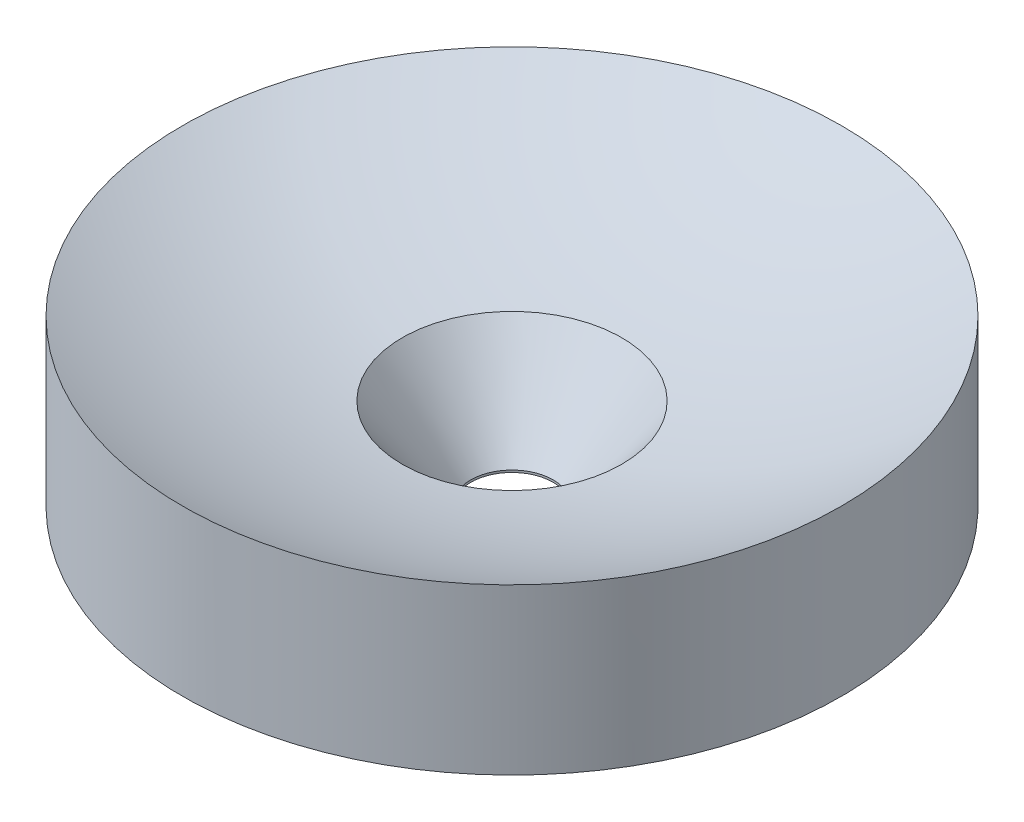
ISO-10303-21;
HEADER;
FILE_DESCRIPTION(('STEP AP214'),'2;1');
FILE_NAME('part.step','',(''),(''),'','','');
FILE_SCHEMA(('AUTOMOTIVE_DESIGN { 1 0 10303 214 1 1 1 1 }'));
ENDSEC;
DATA;
#1=APPLICATION_CONTEXT('core data for automotive mechanical design processes');
#2=APPLICATION_PROTOCOL_DEFINITION('international standard','automotive_design',2000,#1);
#3=PRODUCT_CONTEXT('',#1,'mechanical');
#4=PRODUCT('Part','Part','',(#3));
#5=PRODUCT_RELATED_PRODUCT_CATEGORY('part','',(#4));
#6=PRODUCT_DEFINITION_FORMATION('','',#4);
#7=PRODUCT_DEFINITION_CONTEXT('part definition',#1,'design');
#8=PRODUCT_DEFINITION('design','',#6,#7);
#9=PRODUCT_DEFINITION_SHAPE('','',#8);
#10=(LENGTH_UNIT() NAMED_UNIT(*) SI_UNIT(.MILLI.,.METRE.));
#11=(NAMED_UNIT(*) PLANE_ANGLE_UNIT() SI_UNIT($,.RADIAN.));
#12=(NAMED_UNIT(*) SI_UNIT($,.STERADIAN.) SOLID_ANGLE_UNIT());
#13=UNCERTAINTY_MEASURE_WITH_UNIT(LENGTH_MEASURE(1.E-05),#10,'distance_accuracy_value','');
#14=(GEOMETRIC_REPRESENTATION_CONTEXT(3) GLOBAL_UNCERTAINTY_ASSIGNED_CONTEXT((#13)) GLOBAL_UNIT_ASSIGNED_CONTEXT((#10,
#11,#12)) REPRESENTATION_CONTEXT('',''));
#15=CARTESIAN_POINT('',(0.,0.,0.));
#16=DIRECTION('',(0.,0.,1.));
#17=DIRECTION('',(1.,0.,0.));
#18=AXIS2_PLACEMENT_3D('',#15,#16,#17);
#19=CARTESIAN_POINT('',(0.,0.,0.));
#20=DIRECTION('',(0.,-1.,0.));
#21=DIRECTION('',(0.,0.,-1.));
#22=AXIS2_PLACEMENT_3D('',#19,#20,#21);
#23=PLANE('',#22);
#24=CARTESIAN_POINT('',(0.,0.,0.));
#25=DIRECTION('',(0.,-1.,0.));
#26=DIRECTION('',(0.,0.,-1.));
#27=AXIS2_PLACEMENT_3D('',#24,#25,#26);
#28=CIRCLE('',#27,3.17499999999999);
#29=CARTESIAN_POINT('',(0.,0.,-3.17499999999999));
#30=VERTEX_POINT('',#29);
#31=EDGE_CURVE('E48',#30,#30,#28,.T.);
#32=ORIENTED_EDGE('',*,*,#31,.F.);
#33=EDGE_LOOP('',(#32));
#34=FACE_BOUND('',#33,.T.);
#35=CARTESIAN_POINT('',(0.,0.,0.));
#36=DIRECTION('',(0.,-1.,0.));
#37=DIRECTION('',(0.,0.,-1.));
#38=AXIS2_PLACEMENT_3D('',#35,#36,#37);
#39=CIRCLE('',#38,25.4);
#40=CARTESIAN_POINT('',(0.,0.,-25.4));
#41=VERTEX_POINT('',#40);
#42=EDGE_CURVE('E39',#41,#41,#39,.T.);
#43=ORIENTED_EDGE('',*,*,#42,.T.);
#44=EDGE_LOOP('',(#43));
#45=FACE_BOUND('',#44,.T.);
#46=ADVANCED_FACE('F28',(#34,#45),#23,.T.);
#47=CARTESIAN_POINT('',(0.,0.,0.));
#48=DIRECTION('',(0.,-1.,0.));
#49=DIRECTION('',(0.,0.,-1.));
#50=AXIS2_PLACEMENT_3D('',#47,#48,#49);
#51=CYLINDRICAL_SURFACE('',#50,25.4);
#52=CARTESIAN_POINT('',(0.,12.7,0.));
#53=DIRECTION('',(0.,-1.,0.));
#54=DIRECTION('',(0.,0.,-1.));
#55=AXIS2_PLACEMENT_3D('',#52,#53,#54);
#56=CIRCLE('',#55,25.4);
#57=CARTESIAN_POINT('',(25.4,12.7,0.));
#58=VERTEX_POINT('',#57);
#59=EDGE_CURVE('E43',#58,#58,#56,.T.);
#60=ORIENTED_EDGE('',*,*,#59,.T.);
#61=EDGE_LOOP('',(#60));
#62=FACE_BOUND('',#61,.T.);
#63=ORIENTED_EDGE('',*,*,#42,.F.);
#64=EDGE_LOOP('',(#63));
#65=FACE_BOUND('',#64,.T.);
#66=ADVANCED_FACE('F56',(#62,#65),#51,.T.);
#67=CARTESIAN_POINT('',(0.,60.325,0.));
#68=DIRECTION('',(0.,-1.,0.));
#69=DIRECTION('',(1.,0.,0.));
#70=AXIS2_PLACEMENT_3D('',#67,#68,#69);
#71=SPHERICAL_SURFACE('',#70,53.975);
#72=CARTESIAN_POINT('',(0.,7.01678139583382,0.));
#73=DIRECTION('',(0.,1.,0.));
#74=DIRECTION('',(0.,0.,1.));
#75=AXIS2_PLACEMENT_3D('',#72,#73,#74);
#76=CIRCLE('',#75,8.45780433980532);
#77=CARTESIAN_POINT('',(8.45780433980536,7.01678139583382,0.));
#78=VERTEX_POINT('',#77);
#79=EDGE_CURVE('E10',#78,#78,#76,.F.);
#80=CARTESIAN_POINT('',(8.45780433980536,7.01678139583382,0.));
#81=CARTESIAN_POINT('',(8.64250083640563,7.04608503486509,0.));
#82=CARTESIAN_POINT('',(8.82704502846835,7.0763486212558,0.));
#83=CARTESIAN_POINT('',(9.19580889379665,7.13879225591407,0.));
#84=CARTESIAN_POINT('',(9.38002856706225,7.17097230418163,0.));
#85=CARTESIAN_POINT('',(9.7481234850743,7.23724542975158,0.));
#86=CARTESIAN_POINT('',(9.93199872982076,7.27133850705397,0.));
#87=CARTESIAN_POINT('',(10.2993849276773,7.34143399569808,0.));
#88=CARTESIAN_POINT('',(10.4828958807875,7.3774364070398,0.));
#89=CARTESIAN_POINT('',(10.8495336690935,7.45134667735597,0.));
#90=CARTESIAN_POINT('',(11.0326605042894,7.48925453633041,0.));
#91=CARTESIAN_POINT('',(11.3985102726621,7.56697160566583,0.));
#92=CARTESIAN_POINT('',(11.5812332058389,7.6067808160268,0.));
#93=CARTESIAN_POINT('',(11.9462554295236,7.68829628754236,0.));
#94=CARTESIAN_POINT('',(12.1285547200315,7.73000254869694,0.));
#95=CARTESIAN_POINT('',(12.4927099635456,7.81530761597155,0.));
#96=CARTESIAN_POINT('',(12.6745659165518,7.85890642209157,0.));
#97=CARTESIAN_POINT('',(13.0378148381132,7.94799186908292,0.));
#98=CARTESIAN_POINT('',(13.2192078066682,7.99347850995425,0.));
#99=CARTESIAN_POINT('',(13.5815111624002,8.08633471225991,0.));
#100=CARTESIAN_POINT('',(13.762421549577,8.13370427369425,0.));
#101=CARTESIAN_POINT('',(14.1237401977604,8.23032119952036,0.));
#102=CARTESIAN_POINT('',(14.3041484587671,8.27956856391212,0.));
#103=CARTESIAN_POINT('',(14.6644433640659,8.37993577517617,0.));
#104=CARTESIAN_POINT('',(14.8443300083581,8.43105562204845,0.));
#105=CARTESIAN_POINT('',(15.2035622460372,8.53516227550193,0.));
#106=CARTESIAN_POINT('',(15.3829078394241,8.58814908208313,0.));
#107=CARTESIAN_POINT('',(15.7410385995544,8.6959839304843,0.));
#108=CARTESIAN_POINT('',(15.9198237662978,8.75083197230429,0.));
#109=CARTESIAN_POINT('',(16.2768143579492,8.86238336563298,0.));
#110=CARTESIAN_POINT('',(16.4550197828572,8.9190867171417,0.));
#111=CARTESIAN_POINT('',(16.8108316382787,9.03434260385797,0.));
#112=CARTESIAN_POINT('',(16.9884380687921,9.09289513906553,0.));
#113=CARTESIAN_POINT('',(17.3430327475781,9.21184306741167,0.));
#114=CARTESIAN_POINT('',(17.5200209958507,9.27223846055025,0.));
#115=CARTESIAN_POINT('',(17.8733601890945,9.39486557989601,0.));
#116=CARTESIAN_POINT('',(18.0497111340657,9.45709730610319,0.));
#117=CARTESIAN_POINT('',(18.4017566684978,9.58339036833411,0.));
#118=CARTESIAN_POINT('',(18.5774512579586,9.64745170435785,0.));
#119=CARTESIAN_POINT('',(18.9281651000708,9.77739706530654,0.));
#120=CARTESIAN_POINT('',(19.1031843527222,9.8432810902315,0.));
#121=CARTESIAN_POINT('',(19.452528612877,9.9768647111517,0.));
#122=CARTESIAN_POINT('',(19.6268536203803,10.0445643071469,0.));
#123=CARTESIAN_POINT('',(19.9747905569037,10.1817717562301,0.));
#124=CARTESIAN_POINT('',(20.1484024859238,10.251279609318,0.));
#125=CARTESIAN_POINT('',(20.4948945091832,10.3920960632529,0.));
#126=CARTESIAN_POINT('',(20.6677746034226,10.4634046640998,0.));
#127=CARTESIAN_POINT('',(21.0127842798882,10.6078149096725,0.));
#128=CARTESIAN_POINT('',(21.1849138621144,10.6809165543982,0.));
#129=CARTESIAN_POINT('',(21.5284039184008,10.8289049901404,0.));
#130=CARTESIAN_POINT('',(21.6997643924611,10.9037917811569,0.));
#131=CARTESIAN_POINT('',(22.0416977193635,11.0553424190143,0.));
#132=CARTESIAN_POINT('',(22.2122705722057,11.1320062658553,0.));
#133=CARTESIAN_POINT('',(22.5526102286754,11.2871027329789,0.));
#134=CARTESIAN_POINT('',(22.7223770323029,11.3655353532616,0.));
#135=CARTESIAN_POINT('',(23.0610862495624,11.5241608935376,0.));
#136=CARTESIAN_POINT('',(23.2300286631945,11.604353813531,0.));
#137=CARTESIAN_POINT('',(23.5670708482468,11.7664912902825,0.));
#138=CARTESIAN_POINT('',(23.7351706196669,11.8484358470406,0.));
#139=CARTESIAN_POINT('',(24.0705093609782,12.0140677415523,0.));
#140=CARTESIAN_POINT('',(24.2377483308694,12.0977550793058,0.));
#141=CARTESIAN_POINT('',(24.5713473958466,12.2668635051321,0.));
#142=CARTESIAN_POINT('',(24.7377074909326,12.3522845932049,0.));
#143=CARTESIAN_POINT('',(25.0695308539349,12.5248512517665,0.));
#144=CARTESIAN_POINT('',(25.2349941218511,12.6119968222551,0.));
#145=CARTESIAN_POINT('',(25.4,12.7,0.));
#146=B_SPLINE_CURVE_WITH_KNOTS('',3,(#80,#81,#82,#83,#84,#85,#86,#87,#88,#89,#90,#91,#92,#93,
#94,#95,#96,#97,#98,#99,#100,#101,#102,#103,#104,#105,#106,#107,#108,#109,#110,#111,#112,#113,
#114,#115,#116,#117,#118,#119,#120,#121,#122,#123,#124,#125,#126,#127,#128,#129,#130,#131,#132,
#133,#134,#135,#136,#137,#138,#139,#140,#141,#142,#143,#144,#145),.UNSPECIFIED.,.F.,.F.,(4,2,2,
2,2,2,2,2,2,2,2,2,2,2,2,2,2,2,2,2,2,2,2,2,2,2,2,2,2,2,2,2,4),(0.,0.561017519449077,
1.12203503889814,1.68305255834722,2.2440700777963,2.80508759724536,3.36610511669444,
3.92712263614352,4.48814015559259,5.04915767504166,5.61017519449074,6.17119271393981,
6.73221023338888,7.29322775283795,7.85424527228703,8.4152627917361,8.97628031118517,
9.53729783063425,10.0983153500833,10.6593328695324,11.2203503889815,11.7813679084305,
12.3423854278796,12.9034029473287,13.4644204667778,14.0254379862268,14.5864555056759,
15.147473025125,15.7084905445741,16.2695080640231,16.8305255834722,17.3915431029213,
17.9525606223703),.UNSPECIFIED.);
#147=EDGE_CURVE('BSEAM60',#78,#58,#146,.T.);
#148=ORIENTED_EDGE('',*,*,#79,.T.);
#149=ORIENTED_EDGE('',*,*,#59,.F.);
#150=ORIENTED_EDGE('',*,*,#147,.T.);
#151=ORIENTED_EDGE('',*,*,#147,.F.);
#152=EDGE_LOOP('',(#148,#150,#149,#151));
#153=FACE_BOUND('',#152,.T.);
#154=ADVANCED_FACE('F60',(#153),#71,.F.);
#155=CARTESIAN_POINT('',(0.,0.,0.));
#156=DIRECTION('',(0.,-1.,0.));
#157=DIRECTION('',(0.,0.,-1.));
#158=AXIS2_PLACEMENT_3D('',#155,#156,#157);
#159=CYLINDRICAL_SURFACE('',#158,3.17499999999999);
#160=CARTESIAN_POINT('',(0.,0.163779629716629,0.));
#161=DIRECTION('',(0.,1.,0.));
#162=DIRECTION('',(0.,0.,1.));
#163=AXIS2_PLACEMENT_3D('',#160,#161,#162);
#164=CIRCLE('',#163,3.17499999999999);
#165=CARTESIAN_POINT('',(0.,0.163779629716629,3.17499999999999));
#166=VERTEX_POINT('',#165);
#167=EDGE_CURVE('E35',#166,#166,#164,.T.);
#168=ORIENTED_EDGE('',*,*,#167,.T.);
#169=EDGE_LOOP('',(#168));
#170=FACE_BOUND('',#169,.T.);
#171=ORIENTED_EDGE('',*,*,#31,.T.);
#172=EDGE_LOOP('',(#171));
#173=FACE_BOUND('',#172,.T.);
#174=ADVANCED_FACE('F52',(#170,#173),#159,.F.);
#175=CARTESIAN_POINT('',(0.,0.163779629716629,0.));
#176=DIRECTION('',(0.,1.,0.));
#177=DIRECTION('',(0.,0.,1.));
#178=AXIS2_PLACEMENT_3D('',#175,#176,#177);
#179=CONICAL_SURFACE('',#178,3.17499999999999,0.656727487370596);
#180=ORIENTED_EDGE('',*,*,#79,.F.);
#181=EDGE_LOOP('',(#180));
#182=FACE_BOUND('',#181,.T.);
#183=ORIENTED_EDGE('',*,*,#167,.F.);
#184=EDGE_LOOP('',(#183));
#185=FACE_BOUND('',#184,.T.);
#186=ADVANCED_FACE('F30',(#182,#185),#179,.F.);
#187=CLOSED_SHELL('',(#46,#66,#154,#174,#186));
#188=MANIFOLD_SOLID_BREP('B2',#187);
#189=ADVANCED_BREP_SHAPE_REPRESENTATION('',(#18,#188),#14);
#190=SHAPE_DEFINITION_REPRESENTATION(#9,#189);
ENDSEC;
END-ISO-10303-21;
